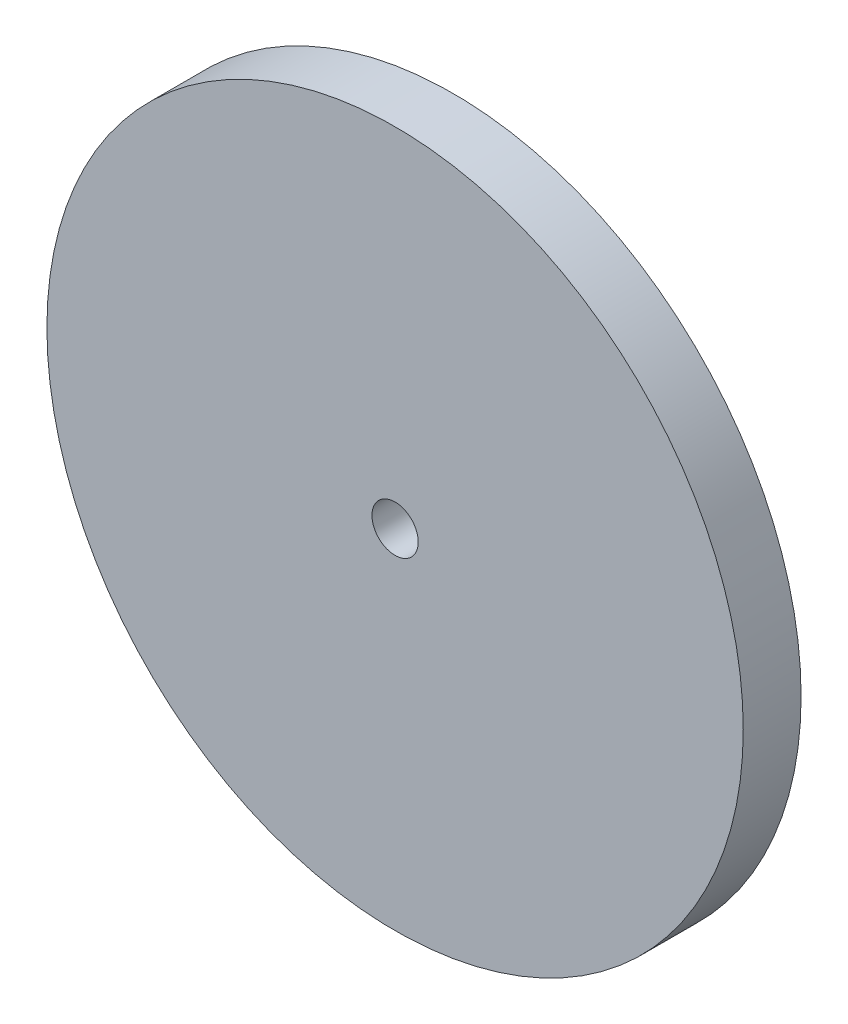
from build123d import *

# Parameters (mm, degrees)
SKETCH1_R           = 60.2
SKETCH1_R_2         = 4
BOSS_EXTRUDE2_DEPTH = 10


with BuildPart() as part:
    # Sketch1 → Boss-Extrude2 (new body)
    with BuildSketch(Plane.XY):
        Circle(SKETCH1_R)
        Circle(SKETCH1_R_2, mode=Mode.SUBTRACT)
    extrude(amount=BOSS_EXTRUDE2_DEPTH)


solid = part.part
